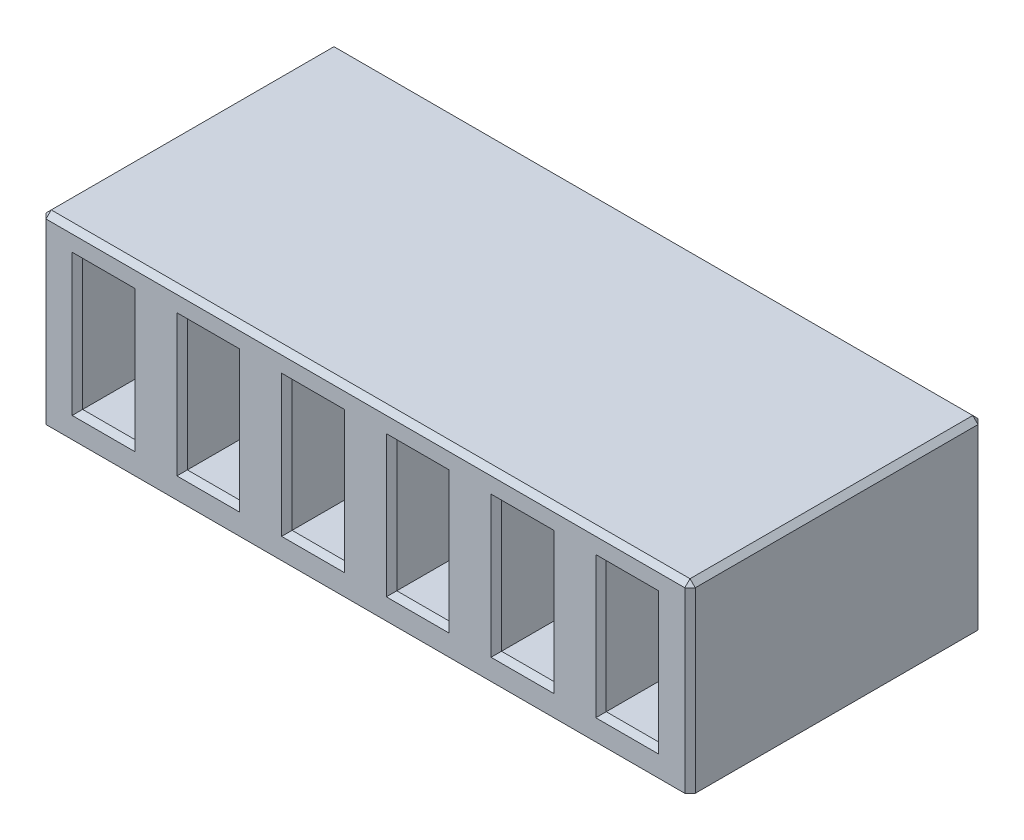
from build123d import *

# Parameters (mm, degrees)
SKETCH1_W                  = 12.4
SKETCH1_H                  = 5.6
BOSS_EXTRUDE1_DEPTH        = 3.5
SKETCH2_W                  = 1
SKETCH2_H                  = 2.5
CUT_EXTRUDE1_DEPTH         = 4
CHAMFER1_SIZE              = 0.1
CUT_EXTRUDE2_REACH         = 10.166
SKETCH3_W                  = 0.5
SKETCH3_H                  = 0.5
CHAMFER3_SIZE              = 0.05
LPATTERN1_COUNT            = 6
LPATTERN1_PITCH            = 2
CHAMFER1_OF_LPATTERN1_SIZE = 0.1
CHAMFER3_OF_LPATTERN1_SIZE = 0.05
CHAMFER2_SIZE              = 0.1


with BuildPart() as part:
    # Sketch1 → Boss-Extrude1 (new body)
    with BuildSketch(Plane(origin=(0, 0, 0), x_dir=(1, 0, 0), z_dir=(0, 1, 0))):
        Rectangle(SKETCH1_W, SKETCH1_H)
    extrude(amount=BOSS_EXTRUDE1_DEPTH)

    # Sketch2 → Cut-Extrude1 (cut)
    with BuildSketch(Plane.XY.offset(2.8)):
        with Locations((-5, 1.75)):
            Rectangle(SKETCH2_W, SKETCH2_H)
    cut_extrude1 = extrude(amount=-CUT_EXTRUDE1_DEPTH, mode=Mode.SUBTRACT)

    # Chamfer1
    chamfer1_edges = [part.edges().sort_by_distance(p)[0] for p in [
        (-5, 3, 2.8),
        (-4.5, 1.75, 2.8),
        (-5.5, 1.75, 2.8),
        (-5, 0.5, 2.8),
    ]]
    chamfer(chamfer1_edges, length=CHAMFER1_SIZE)

    # Sketch3 → Cut-Extrude2 (cut, up to next)
    with BuildSketch(Plane.XY.offset(-1.2), mode=Mode.PRIVATE) as cut_extrude2_sk1:
        with Locations((-5, 2.25)):
            Rectangle(SKETCH3_W, SKETCH3_H)
    cut_extrude2_tool1 = extrude(cut_extrude2_sk1.sketch, amount=-CUT_EXTRUDE2_REACH, mode=Mode.PRIVATE) & part.part
    cut_extrude2 = cut_extrude2_tool1.solids().sort_by_distance((-5, 2.25, -1.2))[0]
    add(cut_extrude2, mode=Mode.SUBTRACT)

    # Chamfer3
    chamfer3_edges = [part.edges().sort_by_distance(p)[0] for p in [
        (-5.25, 2.25, -2.8),
        (-5, 2, -2.8),
        (-5, 2.5, -2.8),
        (-4.75, 2.25, -2.8),
    ]]
    chamfer(chamfer3_edges, length=CHAMFER3_SIZE)

    # LPattern1: Cut-Extrude1, Cut-Extrude2 ×6
    with Locations(*[(i * LPATTERN1_PITCH, 0, 0) for i in range(1, LPATTERN1_COUNT)]):
        add(cut_extrude1, mode=Mode.SUBTRACT)
        add(cut_extrude2, mode=Mode.SUBTRACT)

    # Chamfer1 of LPattern1
    chamfer1_of_lpattern1_edges = [part.edges().sort_by_distance(p)[0] for p in [
        (-3, 3, 2.8),
        (-2.5, 1.75, 2.8),
        (-3.5, 1.75, 2.8),
        (-3, 0.5, 2.8),
        (-1, 3, 2.8),
        (-0.5, 1.75, 2.8),
        (-1.5, 1.75, 2.8),
        (-1, 0.5, 2.8),
        (1, 3, 2.8),
        (1.5, 1.75, 2.8),
        (0.5, 1.75, 2.8),
        (1, 0.5, 2.8),
        (3, 3, 2.8),
        (3.5, 1.75, 2.8),
        (2.5, 1.75, 2.8),
        (3, 0.5, 2.8),
        (5, 3, 2.8),
        (5.5, 1.75, 2.8),
        (4.5, 1.75, 2.8),
        (5, 0.5, 2.8),
    ]]
    chamfer(chamfer1_of_lpattern1_edges, length=CHAMFER1_OF_LPATTERN1_SIZE)

    # Chamfer3 of LPattern1
    chamfer3_of_lpattern1_edges = [part.edges().sort_by_distance(p)[0] for p in [
        (-3.25, 2.25, -2.8),
        (-3, 2, -2.8),
        (-3, 2.5, -2.8),
        (-2.75, 2.25, -2.8),
        (-1.25, 2.25, -2.8),
        (-1, 2, -2.8),
        (-1, 2.5, -2.8),
        (-0.75, 2.25, -2.8),
        (0.75, 2.25, -2.8),
        (1, 2, -2.8),
        (1, 2.5, -2.8),
        (1.25, 2.25, -2.8),
        (2.75, 2.25, -2.8),
        (3, 2, -2.8),
        (3, 2.5, -2.8),
        (3.25, 2.25, -2.8),
        (4.75, 2.25, -2.8),
        (5, 2, -2.8),
        (5, 2.5, -2.8),
        (5.25, 2.25, -2.8),
    ]]
    chamfer(chamfer3_of_lpattern1_edges, length=CHAMFER3_OF_LPATTERN1_SIZE)

    # Chamfer2
    chamfer2_edges = [part.edges().sort_by_distance(p)[0] for p in [
        (6.2, 3.5, 0),
        (0, 3.5, -2.8),
        (-6.2, 3.5, 0),
        (0, 3.5, 2.8),
        (-6.2, 1.75, -2.8),
        (6.2, 1.75, -2.8),
        (6.2, 1.75, 2.8),
        (-6.2, 1.75, 2.8),
    ]]
    chamfer(chamfer2_edges, length=CHAMFER2_SIZE)


solid = part.part
